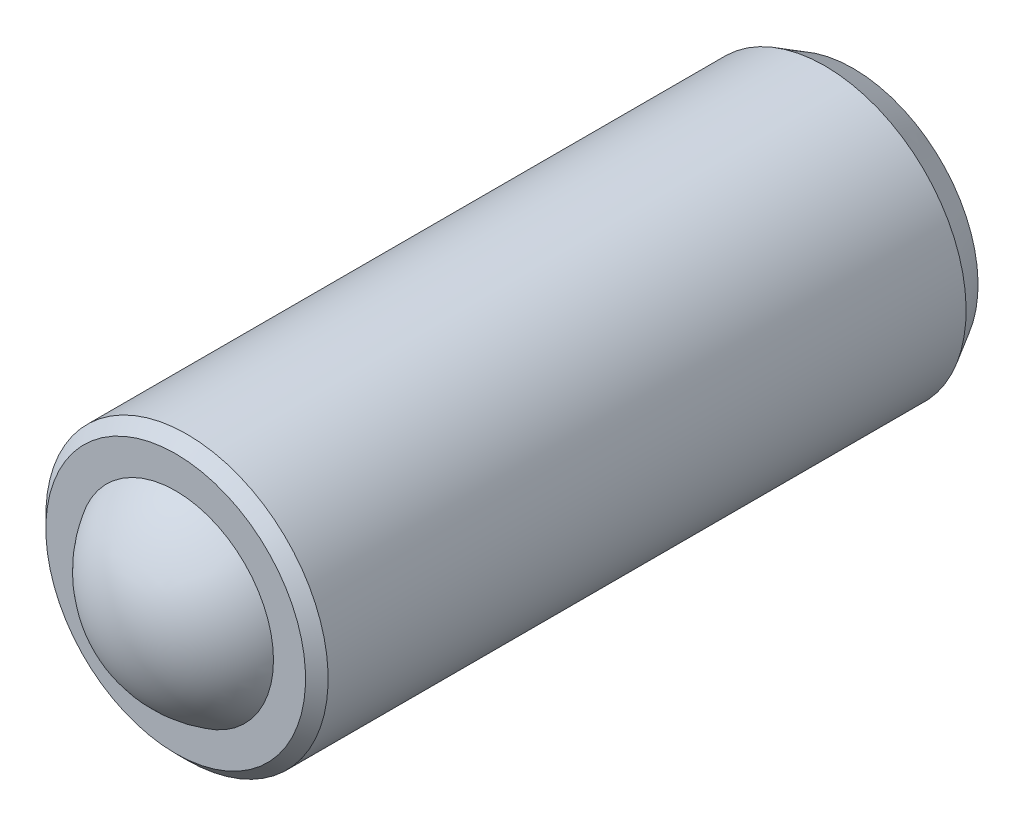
ISO-10303-21;
HEADER;
FILE_DESCRIPTION(('STEP AP214'),'2;1');
FILE_NAME('part.step','',(''),(''),'','','');
FILE_SCHEMA(('AUTOMOTIVE_DESIGN { 1 0 10303 214 1 1 1 1 }'));
ENDSEC;
DATA;
#1=APPLICATION_CONTEXT('core data for automotive mechanical design processes');
#2=APPLICATION_PROTOCOL_DEFINITION('international standard','automotive_design',2000,#1);
#3=PRODUCT_CONTEXT('',#1,'mechanical');
#4=PRODUCT('Part','Part','',(#3));
#5=PRODUCT_RELATED_PRODUCT_CATEGORY('part','',(#4));
#6=PRODUCT_DEFINITION_FORMATION('','',#4);
#7=PRODUCT_DEFINITION_CONTEXT('part definition',#1,'design');
#8=PRODUCT_DEFINITION('design','',#6,#7);
#9=PRODUCT_DEFINITION_SHAPE('','',#8);
#10=(LENGTH_UNIT() NAMED_UNIT(*) SI_UNIT(.MILLI.,.METRE.));
#11=(NAMED_UNIT(*) PLANE_ANGLE_UNIT() SI_UNIT($,.RADIAN.));
#12=(NAMED_UNIT(*) SI_UNIT($,.STERADIAN.) SOLID_ANGLE_UNIT());
#13=UNCERTAINTY_MEASURE_WITH_UNIT(LENGTH_MEASURE(1.E-05),#10,'distance_accuracy_value','');
#14=(GEOMETRIC_REPRESENTATION_CONTEXT(3) GLOBAL_UNCERTAINTY_ASSIGNED_CONTEXT((#13)) GLOBAL_UNIT_ASSIGNED_CONTEXT((#10,
#11,#12)) REPRESENTATION_CONTEXT('',''));
#15=CARTESIAN_POINT('',(0.,0.,0.));
#16=DIRECTION('',(0.,0.,1.));
#17=DIRECTION('',(1.,0.,0.));
#18=AXIS2_PLACEMENT_3D('',#15,#16,#17);
#19=CARTESIAN_POINT('',(0.,0.,0.));
#20=DIRECTION('',(0.,0.,-1.));
#21=DIRECTION('',(0.,1.,0.));
#22=AXIS2_PLACEMENT_3D('',#19,#20,#21);
#23=PLANE('',#22);
#24=CARTESIAN_POINT('',(0.,0.,0.));
#25=DIRECTION('',(0.,0.,-1.));
#26=DIRECTION('',(0.,1.,0.));
#27=AXIS2_PLACEMENT_3D('',#24,#25,#26);
#28=CIRCLE('',#27,2.21132486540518);
#29=CARTESIAN_POINT('',(0.,2.21132486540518,0.));
#30=VERTEX_POINT('',#29);
#31=EDGE_CURVE('E27',#30,#30,#28,.T.);
#32=ORIENTED_EDGE('',*,*,#31,.T.);
#33=EDGE_LOOP('',(#32));
#34=FACE_BOUND('',#33,.T.);
#35=ADVANCED_FACE('F12',(#34),#23,.T.);
#36=CARTESIAN_POINT('',(0.,0.,-5.56770138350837));
#37=DIRECTION('',(0.,0.,-1.));
#38=DIRECTION('',(0.,1.,0.));
#39=AXIS2_PLACEMENT_3D('',#36,#37,#38);
#40=CYLINDRICAL_SURFACE('',#39,2.5);
#41=CARTESIAN_POINT('',(0.,0.,11.8));
#42=DIRECTION('',(0.,0.,1.));
#43=DIRECTION('',(0.,-1.,0.));
#44=AXIS2_PLACEMENT_3D('',#41,#42,#43);
#45=CIRCLE('',#44,2.5);
#46=CARTESIAN_POINT('',(0.,-2.50000000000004,11.8));
#47=VERTEX_POINT('',#46);
#48=EDGE_CURVE('E19',#47,#47,#45,.F.);
#49=ORIENTED_EDGE('',*,*,#48,.T.);
#50=EDGE_LOOP('',(#49));
#51=FACE_BOUND('',#50,.T.);
#52=CARTESIAN_POINT('',(0.,0.,0.500000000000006));
#53=DIRECTION('',(0.,0.,-1.));
#54=DIRECTION('',(0.,1.,0.));
#55=AXIS2_PLACEMENT_3D('',#52,#53,#54);
#56=CIRCLE('',#55,2.5);
#57=CARTESIAN_POINT('',(0.,2.5,0.500000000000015));
#58=VERTEX_POINT('',#57);
#59=EDGE_CURVE('E23',#58,#58,#56,.F.);
#60=ORIENTED_EDGE('',*,*,#59,.T.);
#61=EDGE_LOOP('',(#60));
#62=FACE_BOUND('',#61,.T.);
#63=ADVANCED_FACE('F49',(#51,#62),#40,.T.);
#64=CARTESIAN_POINT('',(2.5,0.,12.));
#65=DIRECTION('',(0.,0.,1.));
#66=DIRECTION('',(0.,-1.,0.));
#67=AXIS2_PLACEMENT_3D('',#64,#65,#66);
#68=PLANE('',#67);
#69=CARTESIAN_POINT('',(0.,0.,12.));
#70=DIRECTION('',(0.,0.,1.));
#71=DIRECTION('',(0.,-1.,0.));
#72=AXIS2_PLACEMENT_3D('',#69,#70,#71);
#73=CIRCLE('',#72,2.3);
#74=CARTESIAN_POINT('',(0.,-2.30000000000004,12.));
#75=VERTEX_POINT('',#74);
#76=EDGE_CURVE('E8',#75,#75,#73,.T.);
#77=ORIENTED_EDGE('',*,*,#76,.T.);
#78=EDGE_LOOP('',(#77));
#79=FACE_BOUND('',#78,.T.);
#80=CARTESIAN_POINT('',(0.,0.,12.));
#81=DIRECTION('',(0.,0.,-1.));
#82=DIRECTION('',(0.,1.,0.));
#83=AXIS2_PLACEMENT_3D('',#80,#81,#82);
#84=CIRCLE('',#83,1.73205080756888);
#85=CARTESIAN_POINT('',(0.,1.73205080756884,12.));
#86=VERTEX_POINT('',#85);
#87=EDGE_CURVE('E32',#86,#86,#84,.T.);
#88=ORIENTED_EDGE('',*,*,#87,.T.);
#89=EDGE_LOOP('',(#88));
#90=FACE_BOUND('',#89,.T.);
#91=ADVANCED_FACE('F36',(#79,#90),#68,.T.);
#92=CARTESIAN_POINT('',(0.,0.,11.));
#93=DIRECTION('',(0.,0.,-1.));
#94=DIRECTION('',(1.,0.,0.));
#95=AXIS2_PLACEMENT_3D('',#92,#93,#94);
#96=SPHERICAL_SURFACE('',#95,2.);
#97=ORIENTED_EDGE('',*,*,#87,.F.);
#98=EDGE_LOOP('',(#97));
#99=FACE_BOUND('',#98,.T.);
#100=ADVANCED_FACE('F38',(#99),#96,.T.);
#101=CARTESIAN_POINT('',(0.,0.,0.));
#102=DIRECTION('',(0.,0.,1.));
#103=DIRECTION('',(0.,-1.,0.));
#104=AXIS2_PLACEMENT_3D('',#101,#102,#103);
#105=CONICAL_SURFACE('',#104,2.21132486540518,0.523598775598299);
#106=ORIENTED_EDGE('',*,*,#59,.F.);
#107=EDGE_LOOP('',(#106));
#108=FACE_BOUND('',#107,.T.);
#109=ORIENTED_EDGE('',*,*,#31,.F.);
#110=EDGE_LOOP('',(#109));
#111=FACE_BOUND('',#110,.T.);
#112=ADVANCED_FACE('F40',(#108,#111),#105,.T.);
#113=CARTESIAN_POINT('',(0.,0.,11.8));
#114=DIRECTION('',(0.,0.,-1.));
#115=DIRECTION('',(0.,1.,0.));
#116=AXIS2_PLACEMENT_3D('',#113,#114,#115);
#117=CONICAL_SURFACE('',#116,2.5,0.785398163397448);
#118=ORIENTED_EDGE('',*,*,#76,.F.);
#119=EDGE_LOOP('',(#118));
#120=FACE_BOUND('',#119,.T.);
#121=ORIENTED_EDGE('',*,*,#48,.F.);
#122=EDGE_LOOP('',(#121));
#123=FACE_BOUND('',#122,.T.);
#124=ADVANCED_FACE('F14',(#120,#123),#117,.T.);
#125=CLOSED_SHELL('',(#35,#63,#91,#100,#112,#124));
#126=MANIFOLD_SOLID_BREP('B1',#125);
#127=ADVANCED_BREP_SHAPE_REPRESENTATION('',(#18,#126),#14);
#128=SHAPE_DEFINITION_REPRESENTATION(#9,#127);
ENDSEC;
END-ISO-10303-21;
